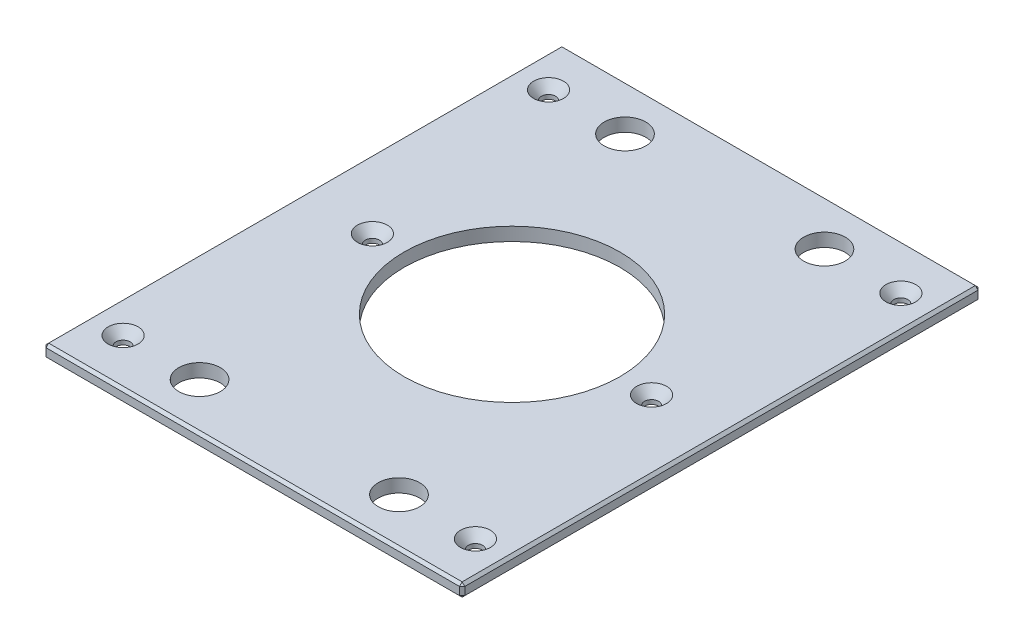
from build123d import *

# Parameters (mm, degrees)
SKETCH1_W                                     = 200.025
SKETCH1_H                                     = 247.65
BOSS_EXTRUDE1_DEPTH                           = 6.35
SKETCH13_R                                    = 51.562
CUT_EXTRUDE6_DEPTH                            = 160.296745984
F_25_32_0_78125_DIAMETER_HOLE1_D              = 19.84375
CHAMFER2_SIZE                                 = 1.27
CSK_FOR_1_4_FLAT_HEAD_MACHINE_SCREW1_AT_COUNT = 2
CSK_FOR_1_4_FLAT_HEAD_MACHINE_SCREW1_AT_PITCH = 203.2
CSK_FOR_1_4_FLAT_HEAD_MACHINE_SCREW1_2_COUNT  = 2
CSK_FOR_1_4_FLAT_HEAD_MACHINE_SCREW1_2_PITCH  = 263.830846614
CSK_FOR_1_4_FLAT_HEAD_MACHINE_SCREW1_3_COUNT  = 2
CSK_FOR_1_4_FLAT_HEAD_MACHINE_SCREW1_3_PITCH  = 181.84325711
CSK_FOR_1_4_FLAT_HEAD_MACHINE_SCREW1_4_COUNT  = 2
CSK_FOR_1_4_FLAT_HEAD_MACHINE_SCREW1_4_PITCH  = 103.089761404
CSK_FOR_1_4_FLAT_HEAD_MACHINE_SCREW1_5_COUNT  = 2
CSK_FOR_1_4_FLAT_HEAD_MACHINE_SCREW1_5_PITCH  = 168.275
CSK_FOR_1_4_FLAT_HEAD_MACHINE_SCREW1_6_COUNT  = 2
CSK_FOR_1_4_FLAT_HEAD_MACHINE_SCREW1_6_PITCH  = 131.7625
CSK_FOR_1_4_FLAT_HEAD_MACHINE_SCREW1_7_COUNT  = 2
CSK_FOR_1_4_FLAT_HEAD_MACHINE_SCREW1_7_PITCH  = 242.180916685


with BuildPart() as part:
    # Sketch1 → Boss-Extrude1 (new body)
    with BuildSketch(Plane(origin=(0, 0, 0), x_dir=(1, 0, 0), z_dir=(0, 1, 0))):
        Rectangle(SKETCH1_W, SKETCH1_H)
    extrude(amount=BOSS_EXTRUDE1_DEPTH)

    # Sketch13 → Cut-Extrude6 (cut, through all)
    with BuildSketch(Plane(origin=(0, 6.35, 0), x_dir=(1, 0, 0), z_dir=(0, 1, 0))):
        with Locations(Location((0, 0, 0), (0, 0, 270))):
            Circle(SKETCH13_R)
    extrude(amount=-CUT_EXTRUDE6_DEPTH, mode=Mode.SUBTRACT)

    # 25_32 _0.78125_ Diameter Hole1 (through all)
    with Locations(Plane(origin=(0, 6.35, 0), x_dir=(1, 0, 0), z_dir=(0, 1, 0))):
        with Locations((47.625, 101.6), (-47.625, 101.6), (47.625, -101.6), (-47.625, -101.6)):
            Hole(F_25_32_0_78125_DIAMETER_HOLE1_D / 2)

    # Chamfer2
    chamfer2_edges = [part.edges().sort_by_distance(p)[0] for p in [
        (100.0125, 6.35, 0),
        (0, 6.35, -123.825),
        (-100.0125, 6.35, 0),
        (0, 0, -123.825),
        (100.0125, 0, 0),
        (0, 0, 123.825),
        (-100.0125, 0, 0),
        (0, 6.35, 123.825),
        (-100.0125, 3.175, -123.825),
        (100.0125, 3.175, -123.825),
        (100.0125, 3.175, 123.825),
        (-100.0125, 3.175, 123.825),
    ]]
    chamfer(chamfer2_edges, length=CHAMFER2_SIZE)

    # Sketch24 → CSK for 1_4 Flat Head Machine Screw1 (revolve, cut)
    with BuildSketch(Plane(origin=(84.1375, 6.35, -101.6), x_dir=(0, 0, 1), z_dir=(1, 0, 0))):
        Polygon((0, 0), (0, 6.35), (3.3782, 6.35), (3.3782, 4.324464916), (7.1374, 0), align=None)
    csk_for_1_4_flat_head_machine_screw1 = revolve(axis=Axis((84.1375, 12.7, -101.6), (0, -1, 0)), mode=Mode.SUBTRACT)

    # CSK for 1_4 Flat Head Machine Screw1 at: CSK for 1_4 Flat Head Machine Screw1 ×2
    with Locations(*[(0, 0, i * CSK_FOR_1_4_FLAT_HEAD_MACHINE_SCREW1_AT_PITCH) for i in range(1, CSK_FOR_1_4_FLAT_HEAD_MACHINE_SCREW1_AT_COUNT)]):
        add(csk_for_1_4_flat_head_machine_screw1, mode=Mode.SUBTRACT)

    # CSK for 1_4 Flat Head Machine Screw1 2: CSK for 1_4 Flat Head Machine Screw1 ×2
    with Locations(*[Vector(-0.6378139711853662, 0, 0.770190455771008) * (i * CSK_FOR_1_4_FLAT_HEAD_MACHINE_SCREW1_2_PITCH) for i in range(1, CSK_FOR_1_4_FLAT_HEAD_MACHINE_SCREW1_2_COUNT)]):
        add(csk_for_1_4_flat_head_machine_screw1, mode=Mode.SUBTRACT)

    # CSK for 1_4 Flat Head Machine Screw1 3: CSK for 1_4 Flat Head Machine Screw1 ×2
    with Locations(*[Vector(-0.8293543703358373, 0, 0.5587229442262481) * (i * CSK_FOR_1_4_FLAT_HEAD_MACHINE_SCREW1_3_PITCH) for i in range(1, CSK_FOR_1_4_FLAT_HEAD_MACHINE_SCREW1_3_COUNT)]):
        add(csk_for_1_4_flat_head_machine_screw1, mode=Mode.SUBTRACT)

    # CSK for 1_4 Flat Head Machine Screw1 4: CSK for 1_4 Flat Head Machine Screw1 ×2
    with Locations(*[Vector(-0.16939121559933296, 0, 0.9855488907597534) * (i * CSK_FOR_1_4_FLAT_HEAD_MACHINE_SCREW1_4_PITCH) for i in range(1, CSK_FOR_1_4_FLAT_HEAD_MACHINE_SCREW1_4_COUNT)]):
        add(csk_for_1_4_flat_head_machine_screw1, mode=Mode.SUBTRACT)

    # CSK for 1_4 Flat Head Machine Screw1 5: CSK for 1_4 Flat Head Machine Screw1 ×2
    with Locations(*[(-i * CSK_FOR_1_4_FLAT_HEAD_MACHINE_SCREW1_5_PITCH, 0, 0) for i in range(1, CSK_FOR_1_4_FLAT_HEAD_MACHINE_SCREW1_5_COUNT)]):
        add(csk_for_1_4_flat_head_machine_screw1, mode=Mode.SUBTRACT)

    # CSK for 1_4 Flat Head Machine Screw1 6: CSK for 1_4 Flat Head Machine Screw1 ×2
    with Locations(*[(-i * CSK_FOR_1_4_FLAT_HEAD_MACHINE_SCREW1_6_PITCH, 0, 0) for i in range(1, CSK_FOR_1_4_FLAT_HEAD_MACHINE_SCREW1_6_COUNT)]):
        add(csk_for_1_4_flat_head_machine_screw1, mode=Mode.SUBTRACT)

    # CSK for 1_4 Flat Head Machine Screw1 7: CSK for 1_4 Flat Head Machine Screw1 ×2
    with Locations(*[Vector(-0.544066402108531, 0, 0.8390421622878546) * (i * CSK_FOR_1_4_FLAT_HEAD_MACHINE_SCREW1_7_PITCH) for i in range(1, CSK_FOR_1_4_FLAT_HEAD_MACHINE_SCREW1_7_COUNT)]):
        add(csk_for_1_4_flat_head_machine_screw1, mode=Mode.SUBTRACT)


solid = part.part
